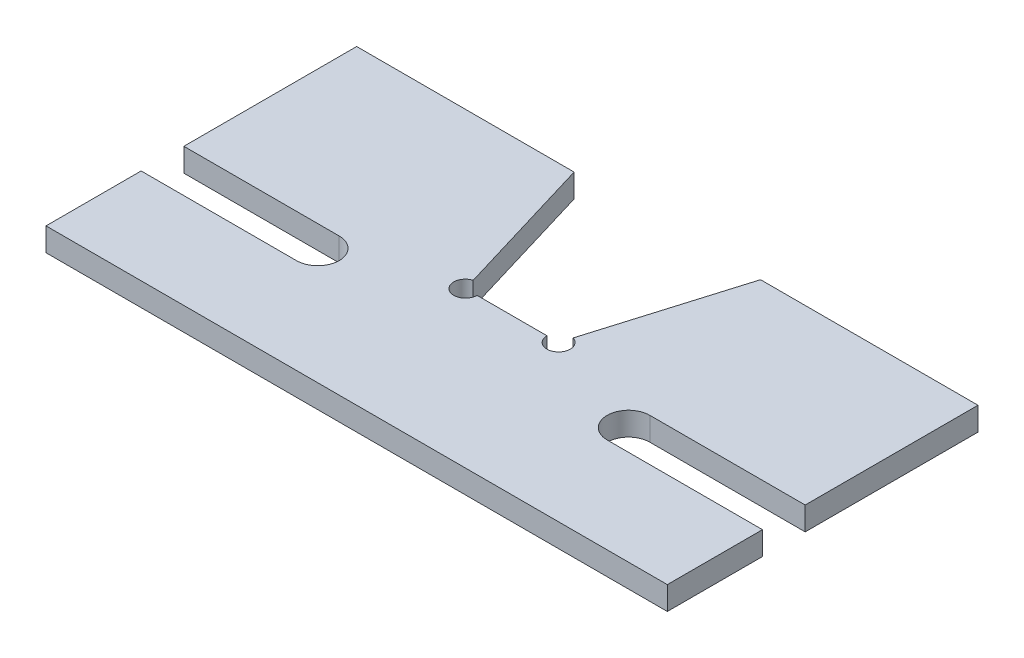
from build123d import *

# Parameters (mm, degrees)
EXTRUDE1_DEPTH = 3


with BuildPart() as part:
    # Sketch1 → Extrude1 (new body)
    with BuildSketch(Plane(origin=(0, 0, 0), x_dir=(1, 0, 0), z_dir=(0, 1, 0))):
        with BuildLine():
            Line((20, 17.75), (0, 17.75))
            Line((0, 17.75), (0, 40))
            Line((0, 40), (28, 40))
            Line((28, 40), (33.568978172, 21.436739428))
            ThreePointArc((33.568978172, 21.436739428), (33.104604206, 18.796560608), (35.5, 20))
            Line((35.5, 20), (44.5, 20))
            ThreePointArc((44.5, 20), (46.895395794, 18.796560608), (46.431021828, 21.436739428))
            Line((46.431021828, 21.436739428), (52, 40))
            Line((52, 40), (80, 40))
            Line((80, 40), (80, 17.75))
            Line((80, 17.75), (60, 17.75))
            ThreePointArc((60, 17.75), (57.25, 15), (60, 12.25))
            Line((60, 12.25), (80, 12.25))
            Line((80, 12.25), (80, 0))
            Line((80, 0), (0, 0))
            Line((0, 0), (0, 12.25))
            Line((0, 12.25), (20, 12.25))
            ThreePointArc((20, 12.25), (22.75, 15), (20, 17.75))
        make_face()
    extrude(amount=EXTRUDE1_DEPTH)


solid = part.part
